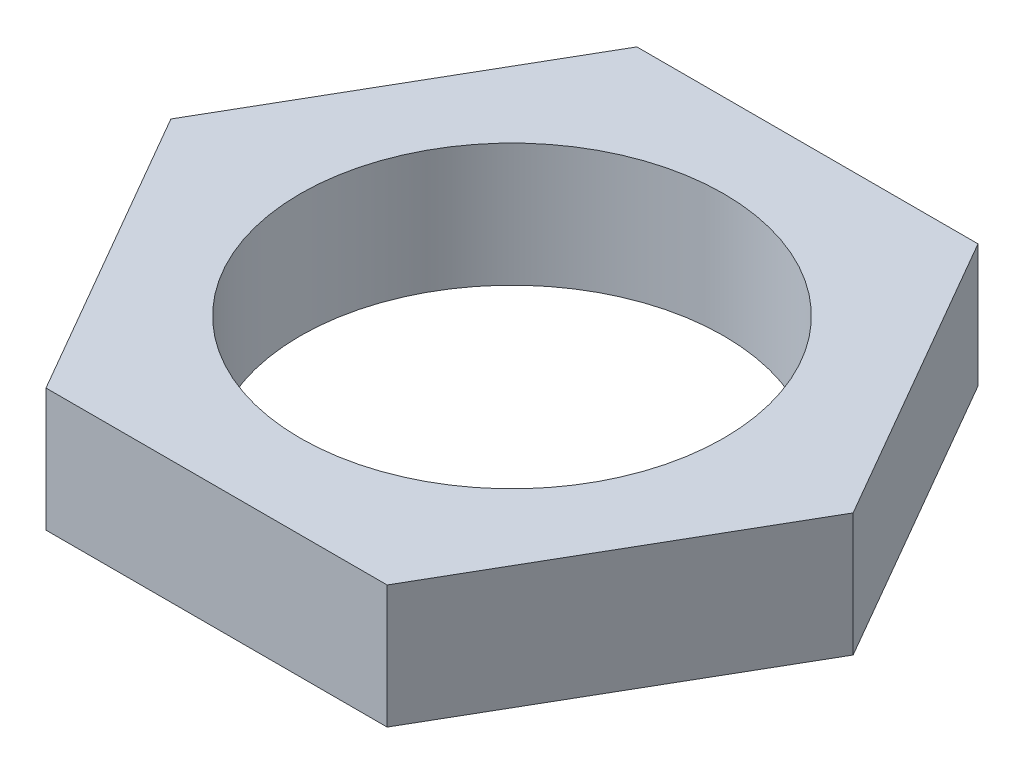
ISO-10303-21;
HEADER;
FILE_DESCRIPTION(('STEP AP214'),'2;1');
FILE_NAME('part.step','',(''),(''),'','','');
FILE_SCHEMA(('AUTOMOTIVE_DESIGN { 1 0 10303 214 1 1 1 1 }'));
ENDSEC;
DATA;
#1=APPLICATION_CONTEXT('core data for automotive mechanical design processes');
#2=APPLICATION_PROTOCOL_DEFINITION('international standard','automotive_design',2000,#1);
#3=PRODUCT_CONTEXT('',#1,'mechanical');
#4=PRODUCT('Part','Part','',(#3));
#5=PRODUCT_RELATED_PRODUCT_CATEGORY('part','',(#4));
#6=PRODUCT_DEFINITION_FORMATION('','',#4);
#7=PRODUCT_DEFINITION_CONTEXT('part definition',#1,'design');
#8=PRODUCT_DEFINITION('design','',#6,#7);
#9=PRODUCT_DEFINITION_SHAPE('','',#8);
#10=(LENGTH_UNIT() NAMED_UNIT(*) SI_UNIT(.MILLI.,.METRE.));
#11=(NAMED_UNIT(*) PLANE_ANGLE_UNIT() SI_UNIT($,.RADIAN.));
#12=(NAMED_UNIT(*) SI_UNIT($,.STERADIAN.) SOLID_ANGLE_UNIT());
#13=UNCERTAINTY_MEASURE_WITH_UNIT(LENGTH_MEASURE(1.E-05),#10,'distance_accuracy_value','');
#14=(GEOMETRIC_REPRESENTATION_CONTEXT(3) GLOBAL_UNCERTAINTY_ASSIGNED_CONTEXT((#13)) GLOBAL_UNIT_ASSIGNED_CONTEXT((#10,
#11,#12)) REPRESENTATION_CONTEXT('',''));
#15=CARTESIAN_POINT('',(0.,0.,0.));
#16=DIRECTION('',(0.,0.,1.));
#17=DIRECTION('',(1.,0.,0.));
#18=AXIS2_PLACEMENT_3D('',#15,#16,#17);
#19=CARTESIAN_POINT('',(6.92820323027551,5.,12.));
#20=DIRECTION('',(0.,1.,0.));
#21=DIRECTION('',(0.,0.,1.));
#22=AXIS2_PLACEMENT_3D('',#19,#20,#21);
#23=PLANE('',#22);
#24=DIRECTION('',(1.,0.,0.));
#25=VECTOR('',#24,1.);
#26=CARTESIAN_POINT('',(-6.92820323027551,5.,12.));
#27=LINE('',#26,#25);
#28=CARTESIAN_POINT('',(-6.92820323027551,5.,12.));
#29=VERTEX_POINT('',#28);
#30=CARTESIAN_POINT('',(6.92820323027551,5.,12.));
#31=VERTEX_POINT('',#30);
#32=EDGE_CURVE('E133',#29,#31,#27,.T.);
#33=ORIENTED_EDGE('',*,*,#32,.T.);
#34=DIRECTION('',(0.5,0.,-0.866025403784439));
#35=VECTOR('',#34,1.);
#36=CARTESIAN_POINT('',(6.92820323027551,5.,12.));
#37=LINE('',#36,#35);
#38=CARTESIAN_POINT('',(13.856406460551,5.,0.));
#39=VERTEX_POINT('',#38);
#40=EDGE_CURVE('E91',#31,#39,#37,.T.);
#41=ORIENTED_EDGE('',*,*,#40,.T.);
#42=DIRECTION('',(-0.5,0.,-0.866025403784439));
#43=VECTOR('',#42,1.);
#44=CARTESIAN_POINT('',(13.856406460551,5.,0.));
#45=LINE('',#44,#43);
#46=CARTESIAN_POINT('',(6.92820323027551,5.,-12.));
#47=VERTEX_POINT('',#46);
#48=EDGE_CURVE('E104',#39,#47,#45,.T.);
#49=ORIENTED_EDGE('',*,*,#48,.T.);
#50=DIRECTION('',(-1.,0.,0.));
#51=VECTOR('',#50,1.);
#52=CARTESIAN_POINT('',(6.92820323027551,5.,-12.));
#53=LINE('',#52,#51);
#54=CARTESIAN_POINT('',(-6.92820323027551,5.,-12.));
#55=VERTEX_POINT('',#54);
#56=EDGE_CURVE('E98',#47,#55,#53,.T.);
#57=ORIENTED_EDGE('',*,*,#56,.T.);
#58=DIRECTION('',(-0.5,0.,0.866025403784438));
#59=VECTOR('',#58,1.);
#60=CARTESIAN_POINT('',(-6.92820323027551,5.,-12.));
#61=LINE('',#60,#59);
#62=CARTESIAN_POINT('',(-13.856406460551,5.,0.));
#63=VERTEX_POINT('',#62);
#64=EDGE_CURVE('E102',#55,#63,#61,.T.);
#65=ORIENTED_EDGE('',*,*,#64,.T.);
#66=DIRECTION('',(0.5,0.,0.866025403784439));
#67=VECTOR('',#66,1.);
#68=CARTESIAN_POINT('',(-13.856406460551,5.,0.));
#69=LINE('',#68,#67);
#70=EDGE_CURVE('E54',#63,#29,#69,.T.);
#71=ORIENTED_EDGE('',*,*,#70,.T.);
#72=EDGE_LOOP('',(#33,#41,#49,#57,#65,#71));
#73=FACE_BOUND('',#72,.T.);
#74=CARTESIAN_POINT('',(0.,5.,0.));
#75=DIRECTION('',(0.,1.,0.));
#76=DIRECTION('',(0.,0.,1.));
#77=AXIS2_PLACEMENT_3D('',#74,#75,#76);
#78=CIRCLE('',#77,8.6);
#79=CARTESIAN_POINT('',(0.,5.,8.6));
#80=VERTEX_POINT('',#79);
#81=EDGE_CURVE('E126',#80,#80,#78,.T.);
#82=ORIENTED_EDGE('',*,*,#81,.F.);
#83=EDGE_LOOP('',(#82));
#84=FACE_BOUND('',#83,.T.);
#85=ADVANCED_FACE('F37',(#73,#84),#23,.T.);
#86=CARTESIAN_POINT('',(6.92820323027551,0.,12.));
#87=DIRECTION('',(0.,1.,0.));
#88=DIRECTION('',(0.,0.,1.));
#89=AXIS2_PLACEMENT_3D('',#86,#87,#88);
#90=PLANE('',#89);
#91=DIRECTION('',(1.,0.,0.));
#92=VECTOR('',#91,1.);
#93=CARTESIAN_POINT('',(-6.92820323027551,0.,12.));
#94=LINE('',#93,#92);
#95=CARTESIAN_POINT('',(-6.92820323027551,0.,12.));
#96=VERTEX_POINT('',#95);
#97=CARTESIAN_POINT('',(6.92820323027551,0.,12.));
#98=VERTEX_POINT('',#97);
#99=EDGE_CURVE('E122',#96,#98,#94,.T.);
#100=ORIENTED_EDGE('',*,*,#99,.F.);
#101=DIRECTION('',(0.5,0.,0.866025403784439));
#102=VECTOR('',#101,1.);
#103=CARTESIAN_POINT('',(-13.856406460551,0.,0.));
#104=LINE('',#103,#102);
#105=CARTESIAN_POINT('',(-13.856406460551,0.,0.));
#106=VERTEX_POINT('',#105);
#107=EDGE_CURVE('E83',#106,#96,#104,.T.);
#108=ORIENTED_EDGE('',*,*,#107,.F.);
#109=DIRECTION('',(-0.5,0.,0.866025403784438));
#110=VECTOR('',#109,1.);
#111=CARTESIAN_POINT('',(-6.92820323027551,0.,-12.));
#112=LINE('',#111,#110);
#113=CARTESIAN_POINT('',(-6.92820323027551,0.,-12.));
#114=VERTEX_POINT('',#113);
#115=EDGE_CURVE('E77',#114,#106,#112,.T.);
#116=ORIENTED_EDGE('',*,*,#115,.F.);
#117=DIRECTION('',(-1.,0.,0.));
#118=VECTOR('',#117,1.);
#119=CARTESIAN_POINT('',(6.92820323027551,0.,-12.));
#120=LINE('',#119,#118);
#121=CARTESIAN_POINT('',(6.92820323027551,0.,-12.));
#122=VERTEX_POINT('',#121);
#123=EDGE_CURVE('E112',#122,#114,#120,.T.);
#124=ORIENTED_EDGE('',*,*,#123,.F.);
#125=DIRECTION('',(-0.5,0.,-0.866025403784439));
#126=VECTOR('',#125,1.);
#127=CARTESIAN_POINT('',(13.856406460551,0.,0.));
#128=LINE('',#127,#126);
#129=CARTESIAN_POINT('',(13.856406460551,0.,0.));
#130=VERTEX_POINT('',#129);
#131=EDGE_CURVE('E128',#130,#122,#128,.T.);
#132=ORIENTED_EDGE('',*,*,#131,.F.);
#133=DIRECTION('',(0.5,0.,-0.866025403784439));
#134=VECTOR('',#133,1.);
#135=CARTESIAN_POINT('',(6.92820323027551,0.,12.));
#136=LINE('',#135,#134);
#137=EDGE_CURVE('E125',#98,#130,#136,.T.);
#138=ORIENTED_EDGE('',*,*,#137,.F.);
#139=EDGE_LOOP('',(#100,#108,#116,#124,#132,#138));
#140=FACE_BOUND('',#139,.T.);
#141=CARTESIAN_POINT('',(0.,0.,0.));
#142=DIRECTION('',(0.,1.,0.));
#143=DIRECTION('',(0.,0.,1.));
#144=AXIS2_PLACEMENT_3D('',#141,#142,#143);
#145=CIRCLE('',#144,8.6);
#146=CARTESIAN_POINT('',(0.,0.,8.6));
#147=VERTEX_POINT('',#146);
#148=EDGE_CURVE('E226',#147,#147,#145,.T.);
#149=ORIENTED_EDGE('',*,*,#148,.T.);
#150=EDGE_LOOP('',(#149));
#151=FACE_BOUND('',#150,.T.);
#152=ADVANCED_FACE('F142',(#140,#151),#90,.F.);
#153=CARTESIAN_POINT('',(-6.92820323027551,5.,12.));
#154=DIRECTION('',(0.,0.,-1.));
#155=DIRECTION('',(-1.,0.,0.));
#156=AXIS2_PLACEMENT_3D('',#153,#154,#155);
#157=PLANE('',#156);
#158=ORIENTED_EDGE('',*,*,#99,.T.);
#159=DIRECTION('',(0.,-1.,0.));
#160=VECTOR('',#159,1.);
#161=CARTESIAN_POINT('',(6.92820323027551,5.,12.));
#162=LINE('',#161,#160);
#163=EDGE_CURVE('E11',#31,#98,#162,.T.);
#164=ORIENTED_EDGE('',*,*,#163,.F.);
#165=ORIENTED_EDGE('',*,*,#32,.F.);
#166=DIRECTION('',(0.,-1.,0.));
#167=VECTOR('',#166,1.);
#168=CARTESIAN_POINT('',(-6.92820323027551,5.,12.));
#169=LINE('',#168,#167);
#170=EDGE_CURVE('E118',#29,#96,#169,.T.);
#171=ORIENTED_EDGE('',*,*,#170,.T.);
#172=EDGE_LOOP('',(#158,#164,#165,#171));
#173=FACE_BOUND('',#172,.T.);
#174=ADVANCED_FACE('F39',(#173),#157,.F.);
#175=CARTESIAN_POINT('',(6.92820323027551,5.,12.));
#176=DIRECTION('',(-0.866025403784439,0.,-0.5));
#177=DIRECTION('',(-0.5,0.,0.866025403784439));
#178=AXIS2_PLACEMENT_3D('',#175,#176,#177);
#179=PLANE('',#178);
#180=ORIENTED_EDGE('',*,*,#137,.T.);
#181=DIRECTION('',(0.,-1.,0.));
#182=VECTOR('',#181,1.);
#183=CARTESIAN_POINT('',(13.856406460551,5.,0.));
#184=LINE('',#183,#182);
#185=EDGE_CURVE('E46',#39,#130,#184,.T.);
#186=ORIENTED_EDGE('',*,*,#185,.F.);
#187=ORIENTED_EDGE('',*,*,#40,.F.);
#188=ORIENTED_EDGE('',*,*,#163,.T.);
#189=EDGE_LOOP('',(#180,#186,#187,#188));
#190=FACE_BOUND('',#189,.T.);
#191=ADVANCED_FACE('F167',(#190),#179,.F.);
#192=CARTESIAN_POINT('',(13.856406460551,5.,0.));
#193=DIRECTION('',(-0.866025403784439,0.,0.5));
#194=DIRECTION('',(0.5,0.,0.866025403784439));
#195=AXIS2_PLACEMENT_3D('',#192,#193,#194);
#196=PLANE('',#195);
#197=ORIENTED_EDGE('',*,*,#131,.T.);
#198=DIRECTION('',(0.,-1.,0.));
#199=VECTOR('',#198,1.);
#200=CARTESIAN_POINT('',(6.92820323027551,5.,-12.));
#201=LINE('',#200,#199);
#202=EDGE_CURVE('E113',#47,#122,#201,.T.);
#203=ORIENTED_EDGE('',*,*,#202,.F.);
#204=ORIENTED_EDGE('',*,*,#48,.F.);
#205=ORIENTED_EDGE('',*,*,#185,.T.);
#206=EDGE_LOOP('',(#197,#203,#204,#205));
#207=FACE_BOUND('',#206,.T.);
#208=ADVANCED_FACE('F139',(#207),#196,.F.);
#209=CARTESIAN_POINT('',(6.92820323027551,5.,-12.));
#210=DIRECTION('',(0.,0.,1.));
#211=DIRECTION('',(1.,0.,0.));
#212=AXIS2_PLACEMENT_3D('',#209,#210,#211);
#213=PLANE('',#212);
#214=ORIENTED_EDGE('',*,*,#123,.T.);
#215=DIRECTION('',(0.,-1.,0.));
#216=VECTOR('',#215,1.);
#217=CARTESIAN_POINT('',(-6.92820323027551,5.,-12.));
#218=LINE('',#217,#216);
#219=EDGE_CURVE('E109',#55,#114,#218,.T.);
#220=ORIENTED_EDGE('',*,*,#219,.F.);
#221=ORIENTED_EDGE('',*,*,#56,.F.);
#222=ORIENTED_EDGE('',*,*,#202,.T.);
#223=EDGE_LOOP('',(#214,#220,#221,#222));
#224=FACE_BOUND('',#223,.T.);
#225=ADVANCED_FACE('F110',(#224),#213,.F.);
#226=CARTESIAN_POINT('',(-6.92820323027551,5.,-12.));
#227=DIRECTION('',(0.866025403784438,0.,0.5));
#228=DIRECTION('',(0.5,0.,-0.866025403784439));
#229=AXIS2_PLACEMENT_3D('',#226,#227,#228);
#230=PLANE('',#229);
#231=ORIENTED_EDGE('',*,*,#115,.T.);
#232=DIRECTION('',(0.,-1.,0.));
#233=VECTOR('',#232,1.);
#234=CARTESIAN_POINT('',(-13.856406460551,5.,0.));
#235=LINE('',#234,#233);
#236=EDGE_CURVE('E114',#63,#106,#235,.T.);
#237=ORIENTED_EDGE('',*,*,#236,.F.);
#238=ORIENTED_EDGE('',*,*,#64,.F.);
#239=ORIENTED_EDGE('',*,*,#219,.T.);
#240=EDGE_LOOP('',(#231,#237,#238,#239));
#241=FACE_BOUND('',#240,.T.);
#242=ADVANCED_FACE('F116',(#241),#230,.F.);
#243=CARTESIAN_POINT('',(-13.856406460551,5.,0.));
#244=DIRECTION('',(0.866025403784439,0.,-0.5));
#245=DIRECTION('',(-0.5,0.,-0.866025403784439));
#246=AXIS2_PLACEMENT_3D('',#243,#244,#245);
#247=PLANE('',#246);
#248=ORIENTED_EDGE('',*,*,#107,.T.);
#249=ORIENTED_EDGE('',*,*,#170,.F.);
#250=ORIENTED_EDGE('',*,*,#70,.F.);
#251=ORIENTED_EDGE('',*,*,#236,.T.);
#252=EDGE_LOOP('',(#248,#249,#250,#251));
#253=FACE_BOUND('',#252,.T.);
#254=ADVANCED_FACE('F147',(#253),#247,.F.);
#255=CARTESIAN_POINT('',(0.,5.,0.));
#256=DIRECTION('',(0.,-1.,0.));
#257=DIRECTION('',(0.,0.,-1.));
#258=AXIS2_PLACEMENT_3D('',#255,#256,#257);
#259=CYLINDRICAL_SURFACE('',#258,8.6);
#260=ORIENTED_EDGE('',*,*,#81,.T.);
#261=EDGE_LOOP('',(#260));
#262=FACE_BOUND('',#261,.T.);
#263=ORIENTED_EDGE('',*,*,#148,.F.);
#264=EDGE_LOOP('',(#263));
#265=FACE_BOUND('',#264,.T.);
#266=ADVANCED_FACE('F149',(#262,#265),#259,.F.);
#267=CLOSED_SHELL('',(#85,#152,#174,#191,#208,#225,#242,#254,#266));
#268=MANIFOLD_SOLID_BREP('B2',#267);
#269=ADVANCED_BREP_SHAPE_REPRESENTATION('',(#18,#268),#14);
#270=SHAPE_DEFINITION_REPRESENTATION(#9,#269);
ENDSEC;
END-ISO-10303-21;
